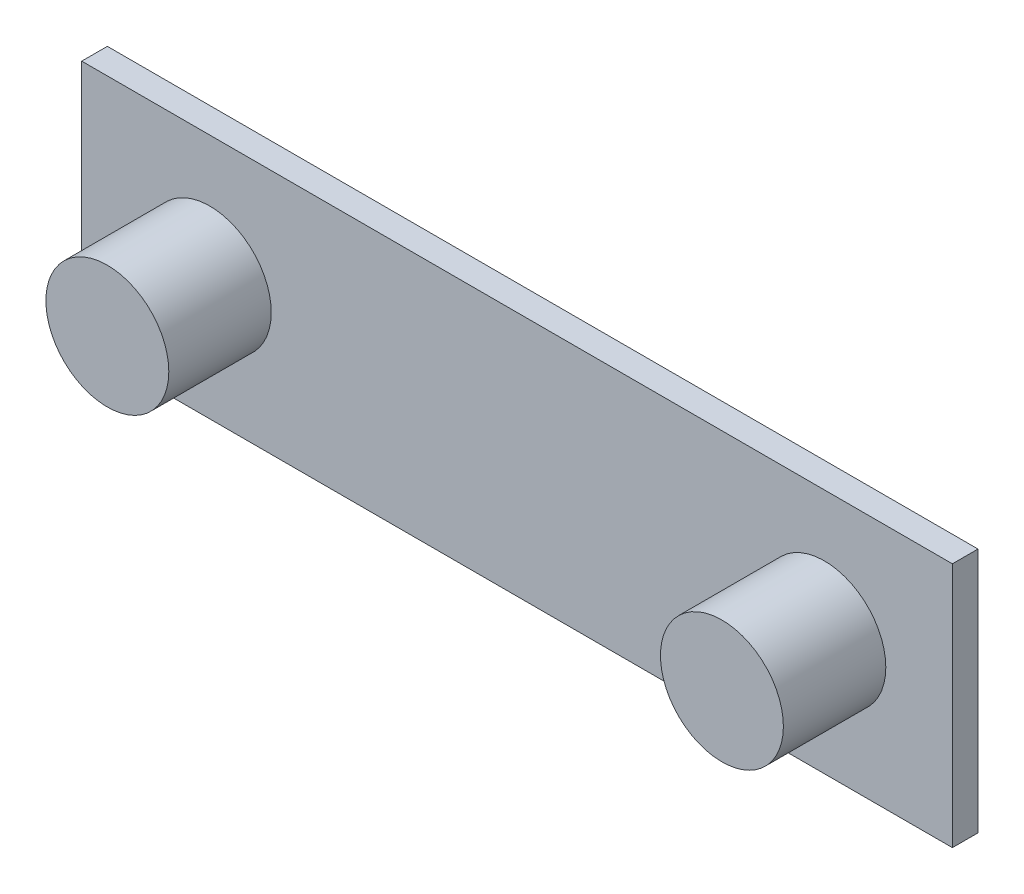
from build123d import *

# Parameters (mm, degrees)
SKETCH1_W           = 85
SKETCH1_H           = 24
BOSS_EXTRUDE1_DEPTH = 2.5
SKETCH2_R           = 6
BOSS_EXTRUDE2_DEPTH = 10


with BuildPart() as part:
    # Sketch1 → Boss-Extrude1 (new body)
    with BuildSketch(Plane.XY):
        with Locations((42.5, 12)):
            Rectangle(SKETCH1_W, SKETCH1_H)
    extrude(amount=BOSS_EXTRUDE1_DEPTH)

    # Sketch2 → Boss-Extrude2 (add)
    with BuildSketch(Plane.XY.offset(2.5)):
        with Locations((72.5, 12)):
            Circle(SKETCH2_R)
        with Locations((12.5, 12)):
            Circle(SKETCH2_R)
    extrude(amount=BOSS_EXTRUDE2_DEPTH)


solid = part.part
